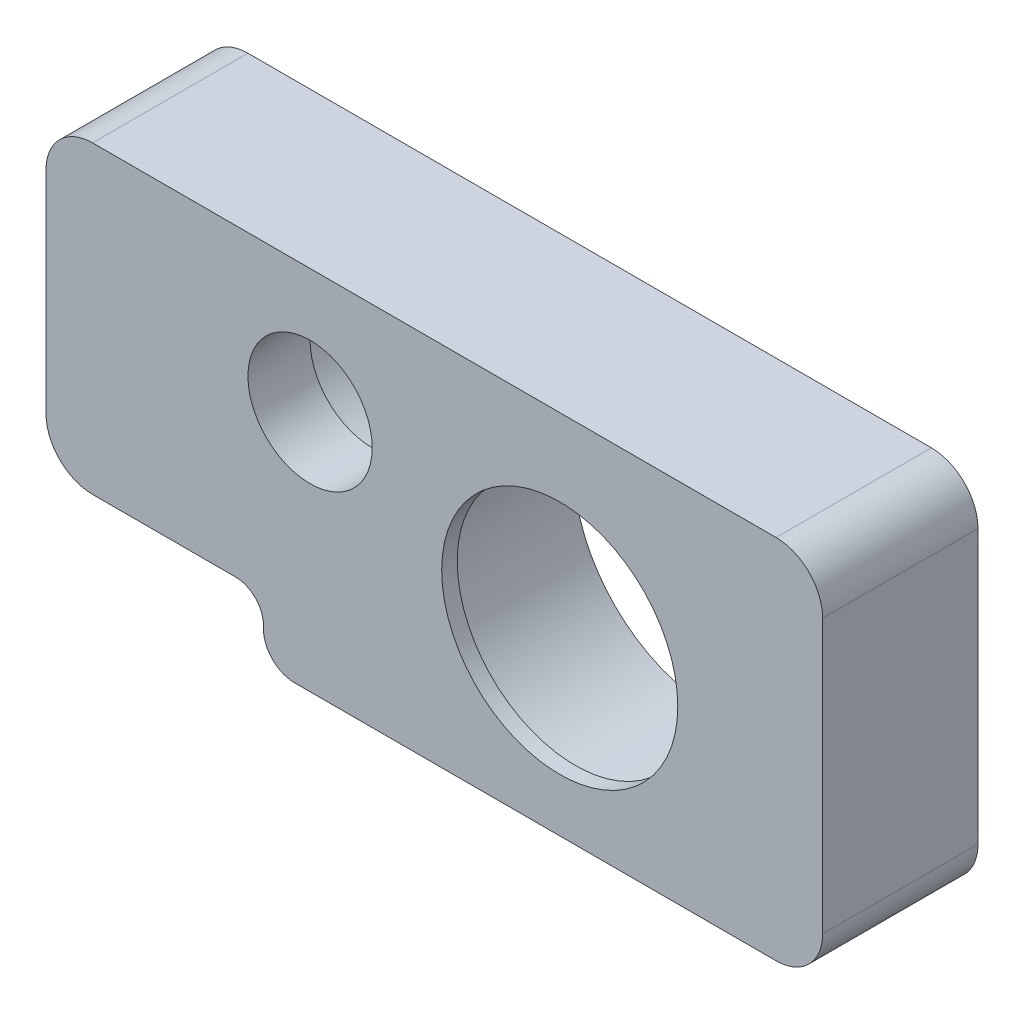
from build123d import *

# Parameters (mm, degrees)
RESSALTO_EXTRUS_O1_DEPTH = 5
ESBO_O2_R                = 2
ESBO_O2_R_2              = 3.8
CORTE_EXTRUS_O1_DEPTH    = 5
ESBO_O3_R                = 3.1
CORTE_EXTRUS_O2_DEPTH    = 3
ESBO_O4_R                = 4.55
CORTE_EXTRUS_O3_DEPTH    = 4.5


with BuildPart() as part:
    # Esbo_o1 → Ressalto-extrus_o1 (new body)
    with BuildSketch(Plane.XY):
        with BuildLine():
            Line((-5.5, -4.8), (-5.5, -4.9))
            ThreePointArc((-5.5, -4.9), (-5.207106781, -5.607106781), (-4.5, -5.9))
            Line((-4.5, -5.9), (11, -5.9))
            ThreePointArc((11, -5.9), (12.060660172, -5.460660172), (12.5, -4.4))
            Line((12.5, -4.4), (12.5, 4.4))
            ThreePointArc((12.5, 4.4), (12.060660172, 5.460660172), (11, 5.9))
            Line((11, 5.9), (-11, 5.9))
            ThreePointArc((-11, 5.9), (-12.060660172, 5.460660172), (-12.5, 4.4))
            Line((-12.5, 4.4), (-12.5, -2.4))
            ThreePointArc((-12.5, -2.4), (-12.060660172, -3.460660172), (-11, -3.9))
            Line((-11, -3.9), (-6.4, -3.9))
            ThreePointArc((-6.4, -3.9), (-5.763603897, -4.163603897), (-5.5, -4.8))
        make_face()
    extrude(amount=RESSALTO_EXTRUS_O1_DEPTH)

    # Esbo_o2 → Corte-extrus_o1 (cut)
    with BuildSketch(Plane.XY.offset(5)):
        with Locations((-4, 1.9)):
            Circle(ESBO_O2_R)
        with Locations((4.03666999, -0.387184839)):
            Circle(ESBO_O2_R_2)
    extrude(amount=-CORTE_EXTRUS_O1_DEPTH, mode=Mode.SUBTRACT)

    # Esbo_o3 → Corte-extrus_o2 (cut)
    with BuildSketch(Plane(origin=(0, 0, 0), x_dir=(-1, 0, 0), z_dir=(0, 0, -1))):
        with Locations((4, 1.9)):
            Circle(ESBO_O3_R)
    extrude(amount=-CORTE_EXTRUS_O2_DEPTH, mode=Mode.SUBTRACT)

    # Esbo_o4 → Corte-extrus_o3 (cut)
    with BuildSketch(Plane(origin=(0, 0, 0), x_dir=(-1, 0, 0), z_dir=(0, 0, -1))):
        with Locations((-4.03666999, -0.387184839)):
            Circle(ESBO_O4_R)
    extrude(amount=-CORTE_EXTRUS_O3_DEPTH, mode=Mode.SUBTRACT)


solid = part.part
